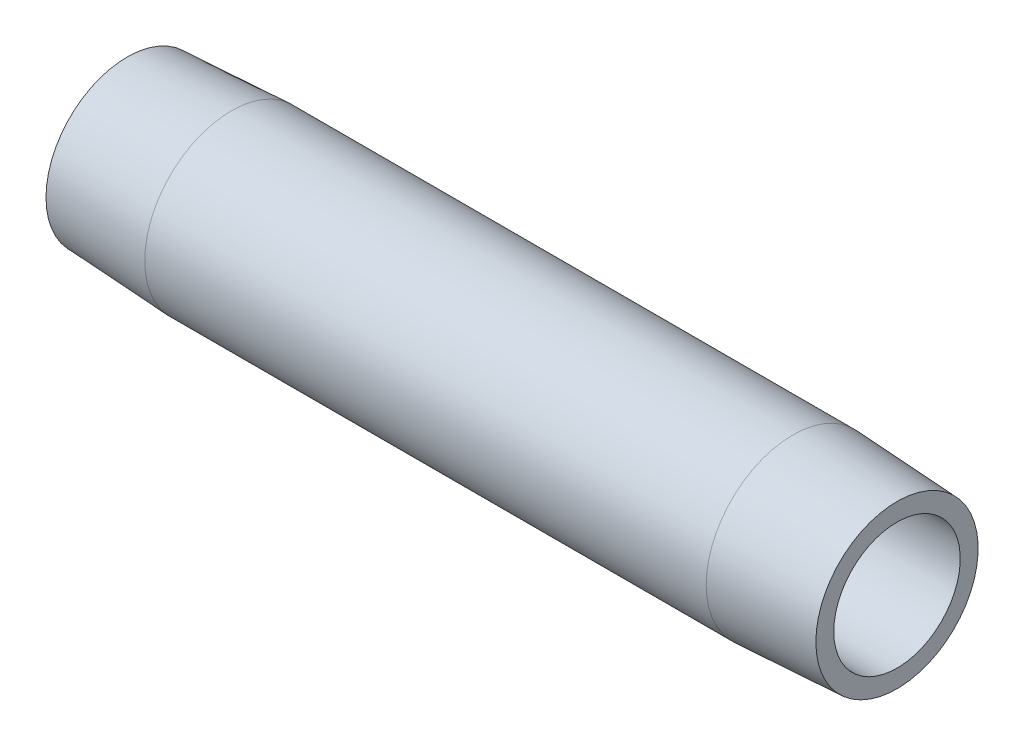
from build123d import *


with BuildPart() as part:
    # Sketch1 → Revolve1 (revolve)
    with BuildSketch(Plane.XY, mode=Mode.PRIVATE) as revolve1_sk:
        Polygon((76.2, 6.2611), (0, 6.2611), (0, 8.032050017), (10.3124, 8.5725), (65.8876, 8.5725), (76.2, 8.032050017), align=None)
    revolve(revolve1_sk.sketch.rotate(Axis((0, 0, 0), (1, 0, 0)), 90), axis=Axis((0, 0, 0), (1, 0, 0)))


solid = part.part
